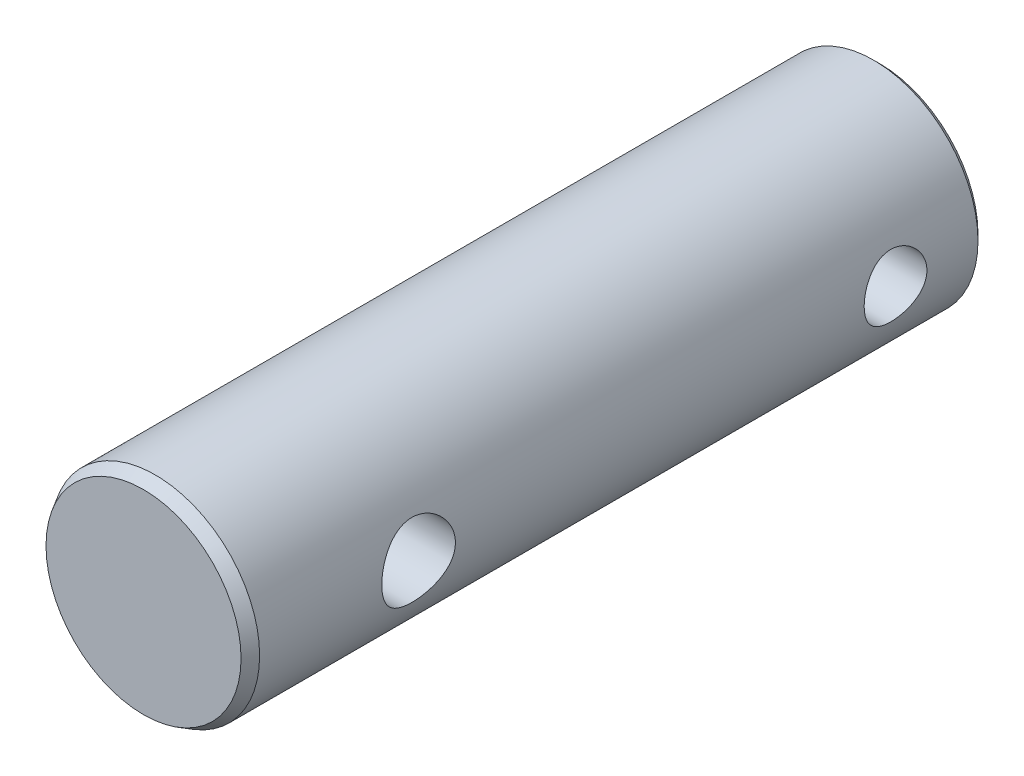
from build123d import *

# Parameters (mm, degrees)
CHAMFER1_SIZE           = 0.508
CHAMFER1_SIZE2          = 0.293293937
SKETCH2_R               = 1.35255
CUT_EXTRUDE1_DEPTH      = 33.381514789
CHAMFER2_SIZE           = 0.254
CUT_EXTRUDE2_DEPTH      = 33.381514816
CUT_EXTRUDE2_DEPTH_BACK = 33.381514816
SKETCH3_R               = 1.5875


with BuildPart() as part:
    # Sketch1 → Revolve1 (revolve)
    with BuildSketch(Plane(origin=(0, 0, 0), x_dir=(0, 0, -1), z_dir=(1, 0, 0)), mode=Mode.PRIVATE) as revolve1_sk:
        Polygon((0, 4.5), (0, 2), (-10.16, 2), (-11.361721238, 0), (-31.75, 0), (-31.75, 4.5), align=None)
    revolve(revolve1_sk.sketch.rotate(Axis((0, 0, 15.211985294), (0, 0, -1)), 90), axis=Axis((0, 0, 15.211985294), (0, 0, -1)))

    # Chamfer1
    chamfer1_edges = [part.edges().sort_by_distance(p)[0] for p in [
        (-4.5, 0, 31.75),
    ]]
    chamfer1_side = [part.faces().sort_by_distance(p)[0] for p in [
        (-4.5, 0, 15.875),
    ]]
    chamfer(chamfer1_edges, length=CHAMFER1_SIZE, length2=CHAMFER1_SIZE2, reference=chamfer1_side[0])

    # Sketch2 → Cut-Extrude1 (cut, through all)
    with BuildSketch(Plane(origin=(0, 0, 0), x_dir=(0, 0, -1), z_dir=(1, 0, 0))):
        with Locations(Location((-3.81, 0, 0), (0, 0, 180))):
            Circle(SKETCH2_R)
    extrude(amount=CUT_EXTRUDE1_DEPTH, mode=Mode.SUBTRACT)

    # Chamfer2
    chamfer2_edges = [part.edges().sort_by_distance(p)[0] for p in [
        (-2, 0, 0),
        (-4.5, 0, 0),
    ]]
    chamfer(chamfer2_edges, length=CHAMFER2_SIZE)

    # Sketch3 → Cut-Extrude2 (cut, two sides: drawn at the far end of the back side and taken through both)
    with BuildSketch(Plane(origin=(0, 0, 0), x_dir=(0, 0, -1), z_dir=(1, 0, 0)).offset(-CUT_EXTRUDE2_DEPTH_BACK)):
        with Locations((-24.384, 0)):
            Circle(SKETCH3_R)
    extrude(amount=CUT_EXTRUDE2_DEPTH + CUT_EXTRUDE2_DEPTH_BACK, mode=Mode.SUBTRACT)


solid = part.part
